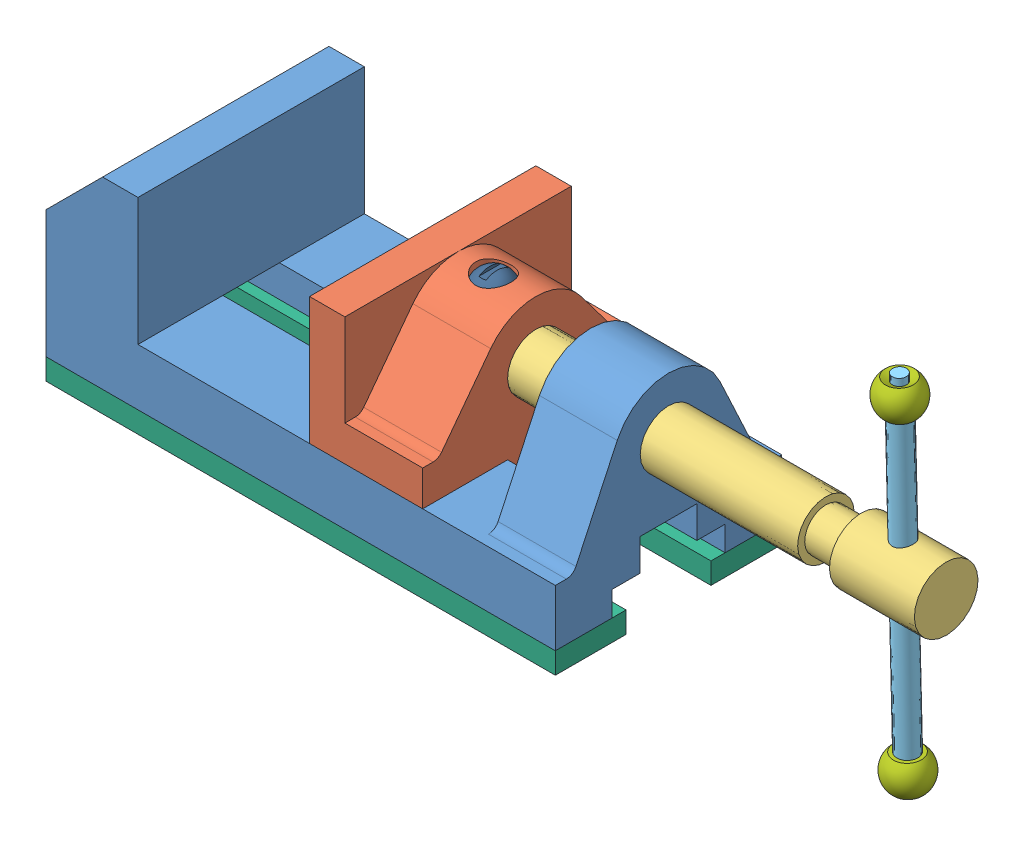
SolidWorks assembly Bench Vice.SLDASM, configuration Default (file format 8000). Lengths in mm.
Overall size (222.5 104.18 64).
16 component instances, 10 part files, 34 mates.
Components (placement in the parent):
- Vice Body-1: Vice Body.SLDPRT [Default] at origin size (144 52 64)
- Vice Jaw-2: Vice Jaw.SLDPRT [Default] at (84.5 16 0) x (0 0 -1) z (1 0 0) size (64 45 32)
- Jaw Screw-3: Jaw Screw.SLDPRT [Default] at (84.5 36 0) x (1 0 0) z (0 -0.999701 -0.024465) size (138 18 18)
- Clamping Plate-3: Clamping Plate.SLDPRT [Default] at (90.5 7 0) x (1 0 0) z (0 0 -1) size (32 7 32)
- Screw Bar-2: Screw Bar.SLDPRT [Default] at (210.5 85.985 1.2232) x (0 -0.999701 -0.024465) z (-0.736594 0.016547 -0.676133) size (104 6 6)
- Base Plate-4: Base Plate.SLDPRT [Default] at (72 0 -22) x (1 0 0) z (0 0 -1) size (144 6 20)
- Base Plate-5: Base Plate.SLDPRT [Default] at (72 0 22) x (1 0 0) z (0 0 -1) size (144 6 20)
- Bar Globes-3: Bar Globes.SLDPRT [Default] at (210.5 -12.4855 -1.1865) x (0 0.999701 0.024465) z (-0.518828 0.020915 -0.854623) size (9 12 12)
- Bar Globes-4: Bar Globes.SLDPRT [Default] at (210.5 80.4867 1.0887) x (0 -0.999701 -0.024465) z (-0.919146 0.009637 -0.393799) size (9 12 12)
- Set Screw1-10: Set Screw1.SLDPRT [Default] at (36 11.7321 -22) x (0.536507 0 -0.843896) z (0 1 0) size (9 8.77 17.73)
- Set Screw1-11: Set Screw1.SLDPRT [Default] at (36 11.7321 22) x (0.536507 0 -0.843896) z (0 1 0) size (9 8.77 17.73)
- Set Screw1-12: Set Screw1.SLDPRT [Default] at (106 11.7321 -22) x (0.353554 0 -0.935414) z (0 1 0) size (9 8.77 17.73)
- Set Screw1-13: Set Screw1.SLDPRT [Default] at (106 11.7321 22) x (0.353554 0 -0.935414) z (0 1 0) size (9 8.77 17.73)
- Set Screw2-3: Set Screw2.SLDPRT [Default] at (82.5 24.7377 0) x (0.233259 0 0.972415) z (0.972415 0 -0.233259) size (11.77 24.73 11.6)
- Set Screw2-4: Set Screw2.SLDPRT [Default] at (98.5 24.7377 0) x (0.240374 0 0.97068) z (0.97068 0 -0.240374) size (11.77 24.73 11.6)
- Oval Fillister-5: Oval Fillister.SLDPRT [Default] at (94.5 40 0) size (10 12.91 10)
Mates (geometry in assembly coordinates):
- Parallel1: parallel anti-aligned: plane of Vice Body-1 through (122 36 0) normal (-1 0 0); plane of Vice Jaw-2 through (106.5 36 0) normal (1 0 0)
- Concentric1: concentric aligned: cylinder of Vice Body-1 through (122 36 0) axis (1 0 0) radius 8; cylinder of Vice Jaw-2 through (82.5 36 0) axis (1 0 0) radius 6
- Parallel2: parallel anti-aligned: plane of Vice Body-1 through (144 16 32) normal (0 1 0); plane of Vice Jaw-2 through (106.5 16 32) normal (0 -1 0)
- Concentric2: concentric aligned: cylinder of Vice Body-1 through (122 36 0) axis (1 0 0) radius 8; cylinder of Jaw Screw-3 through (84.5 36 0) axis (1 0 0) radius 8
- Coincident2: coincident anti-aligned: plane of Jaw Screw-3 through (106.5 35.8532 5.9982) normal (-1 0 0); plane of Vice Jaw-2 through (106.5 36 0) normal (1 0 0)
- LimitDistance1: limit distance = 54.5 mm anti-aligned: plane of Vice Body-1 through (144 0 32) normal (1 0 0); plane of Jaw Screw-3 through (198.5 35.8532 5.9982) normal (-1 0 0)
- Concentric3: concentric aligned: cylinder of Vice Jaw-2 through (82.5 7 0) axis (0 -1 0) radius 3; cylinder of Clamping Plate-3 through (82.5 0 0) axis (0 -1 0) radius 3
- Concentric4: concentric aligned: cylinder of Vice Jaw-2 through (98.5 7 0) axis (0 -1 0) radius 3; cylinder of Clamping Plate-3 through (98.5 0 0) axis (0 -1 0) radius 3
- Coincident3: coincident anti-aligned: plane of Vice Jaw-2 through (106.5 7 8) normal (0 -1 0); plane of Clamping Plate-3 through (106.5 7 16) normal (0 1 0)
- Concentric5: concentric anti-aligned: cylinder of Jaw Screw-3 through (210.5 45.997 0.2446) axis (0 -0.999701 -0.024465) radius 3; cylinder of Screw Bar-2 through (210.5 -17.9838 -1.3211) axis (0 0.999701 0.024465) radius 3
- Distance2: distance = 50 mm: plane of Screw Bar-2 through (210.5 85.985 1.2232) normal (0 0.999701 0.024465); axis of Jaw Screw-3 through (198.5 36 0) axis (1 0 0)
- Concentric6: concentric aligned: cylinder of Vice Body-1 through (36 0 -22) axis (0 -1 0) radius 3; cylinder of Base Plate-4 through (36 -6 -22) axis (0 -1 0) radius 3
- Concentric7: concentric aligned: cylinder of Vice Body-1 through (106 0 -22) axis (0 -1 0) radius 3; cylinder of Base Plate-4 through (106 -6 -22) axis (0 -1 0) radius 3
- Coincident4: coincident anti-aligned: plane of Vice Body-1 through (0 0 32) normal (0 -1 0); plane of Base Plate-4 through (144 0 -12) normal (0 1 0)
- Concentric8: concentric aligned: cylinder of Vice Body-1 through (36 0 22) axis (0 -1 0) radius 3; cylinder of Base Plate-5 through (36 -6 22) axis (0 -1 0) radius 3
- Concentric9: concentric aligned: cylinder of Vice Body-1 through (106 0 22) axis (0 -1 0) radius 3; cylinder of Base Plate-5 through (106 -6 22) axis (0 -1 0) radius 3
- Coincident5: coincident anti-aligned: plane of Vice Body-1 through (0 0 32) normal (0 -1 0); plane of Base Plate-5 through (144 0 32) normal (0 1 0)
- Concentric10: concentric anti-aligned: cylinder of Screw Bar-2 through (210.5 -17.9838 -1.3211) axis (0 0.999701 0.024465) radius 2; cylinder of Bar Globes-3 through (210.5 -16.9841 -1.2966) axis (0 -0.999701 -0.024465) radius 2
- Coincident7: coincident anti-aligned: plane of Screw Bar-2 through (208.471 -8.0409 1.1327) normal (0 -0.999701 -0.024465); plane of Bar Globes-3 through (212.2098 -7.9614 -2.1138) normal (0 0.999701 0.024465)
- Concentric11: concentric aligned: cylinder of Screw Bar-2 through (210.5 -17.9838 -1.3211) axis (0 0.999701 0.024465) radius 2; cylinder of Bar Globes-4 through (210.5 84.9853 1.1988) axis (0 0.999701 0.024465) radius 2
- Coincident8: coincident anti-aligned: plane of Screw Bar-2 through (209.1473 75.952 2.4513) normal (0 0.999701 0.024465); plane of Bar Globes-4 through (209.7122 75.9431 2.8163) normal (0 -0.999701 -0.024465)
- Concentric12: concentric aligned: cylinder of Vice Body-1 through (36 0 -22) axis (0 -1 0) radius 3; cylinder of Set Screw1-10 through (36 11.7321 -22) axis (0 -1 0) radius 3
- Coincident9: coincident aligned: cone of Base Plate-4 through (36 -6 -22) axis (0 1 0); cone of Set Screw1-10 through (36 -2.3787 -22) axis (0 1 0)
- Coincident10: coincident aligned: axis of Base Plate-5 through (36 0 22) axis (0 -1 0); axis of Set Screw1-11 through (36 10 22) axis (0 -1 0)
- Coincident11: coincident aligned: cone of Base Plate-5 through (36 -6 22) axis (0 1 0); cone of Set Screw1-11 through (36 -2.3787 22) axis (0 1 0)
- Coincident12: coincident aligned: axis of Base Plate-4 through (106 0 -22) axis (0 -1 0); axis of Set Screw1-12 through (106 10 -22) axis (0 -1 0)
- Coincident13: coincident aligned: cone of Base Plate-4 through (106 -6 -22) axis (0 1 0); cone of Set Screw1-12 through (106 -2.3787 -22) axis (0 1 0)
- Coincident14: coincident aligned: axis of Base Plate-5 through (106 0 22) axis (0 -1 0); axis of Set Screw1-13 through (106 10 22) axis (0 -1 0)
- Coincident15: coincident aligned: cone of Base Plate-5 through (106 -6 22) axis (0 1 0); cone of Set Screw1-13 through (106 -2.3787 22) axis (0 1 0)
- Coincident17: coincident aligned: cone of Clamping Plate-3 through (82.5 0 0) axis (0 1 0); cone of Set Screw2-3 through (82.5 5.0056 0) axis (0 1 0)
- Coincident18: coincident aligned: cone of Clamping Plate-3 through (98.5 0 0) axis (0 1 0); cone of Set Screw2-4 through (98.5 5.0056 0) axis (0 1 0)
- Concentric14: concentric aligned: cylinder of Vice Jaw-2 through (94.5 52 0) axis (0 1 0) radius 3; cylinder of Oval Fillister-5 through (94.5 40 0) axis (0 1 0) radius 3
- Coincident19: coincident anti-aligned: plane of Vice Jaw-2 through (94.5 48 -3) normal (0 1 0); plane of Oval Fillister-5 through (97.5 48 0) normal (0 -1 0)
- Screw1: screw = 1000 mm aligned: cylinder of Jaw Screw-3 through (84.5 36 0) axis (1 0 0) radius 8; cylinder of Vice Body-1 through (122 36 0) axis (1 0 0) radius 16
